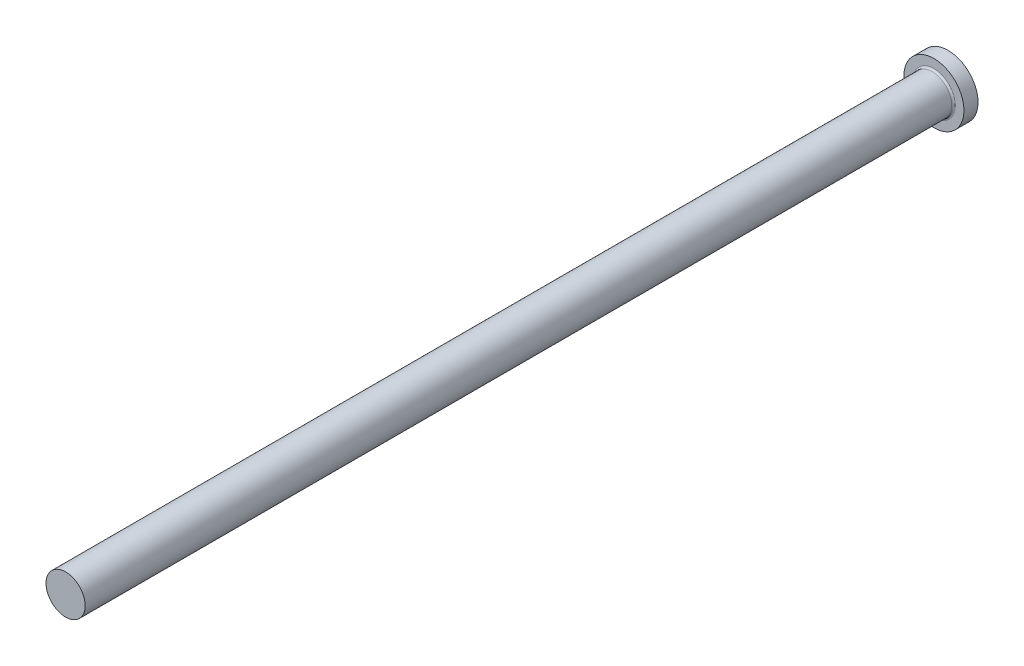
ISO-10303-21;
HEADER;
FILE_DESCRIPTION(('STEP AP214'),'2;1');
FILE_NAME('part.step','',(''),(''),'','','');
FILE_SCHEMA(('AUTOMOTIVE_DESIGN { 1 0 10303 214 1 1 1 1 }'));
ENDSEC;
DATA;
#1=APPLICATION_CONTEXT('core data for automotive mechanical design processes');
#2=APPLICATION_PROTOCOL_DEFINITION('international standard','automotive_design',2000,#1);
#3=PRODUCT_CONTEXT('',#1,'mechanical');
#4=PRODUCT('Part','Part','',(#3));
#5=PRODUCT_RELATED_PRODUCT_CATEGORY('part','',(#4));
#6=PRODUCT_DEFINITION_FORMATION('','',#4);
#7=PRODUCT_DEFINITION_CONTEXT('part definition',#1,'design');
#8=PRODUCT_DEFINITION('design','',#6,#7);
#9=PRODUCT_DEFINITION_SHAPE('','',#8);
#10=(LENGTH_UNIT() NAMED_UNIT(*) SI_UNIT(.MILLI.,.METRE.));
#11=(NAMED_UNIT(*) PLANE_ANGLE_UNIT() SI_UNIT($,.RADIAN.));
#12=(NAMED_UNIT(*) SI_UNIT($,.STERADIAN.) SOLID_ANGLE_UNIT());
#13=UNCERTAINTY_MEASURE_WITH_UNIT(LENGTH_MEASURE(1.E-05),#10,'distance_accuracy_value','');
#14=(GEOMETRIC_REPRESENTATION_CONTEXT(3) GLOBAL_UNCERTAINTY_ASSIGNED_CONTEXT((#13)) GLOBAL_UNIT_ASSIGNED_CONTEXT((#10,
#11,#12)) REPRESENTATION_CONTEXT('',''));
#15=CARTESIAN_POINT('',(0.,0.,0.));
#16=DIRECTION('',(0.,0.,1.));
#17=DIRECTION('',(1.,0.,0.));
#18=AXIS2_PLACEMENT_3D('',#15,#16,#17);
#19=CARTESIAN_POINT('',(8.5,0.,4.));
#20=DIRECTION('',(0.,0.,-1.));
#21=DIRECTION('',(-1.,0.,0.));
#22=AXIS2_PLACEMENT_3D('',#19,#20,#21);
#23=PLANE('',#22);
#24=CARTESIAN_POINT('',(0.,0.,4.));
#25=DIRECTION('',(0.,0.,-1.));
#26=DIRECTION('',(-1.,0.,0.));
#27=AXIS2_PLACEMENT_3D('',#24,#25,#26);
#28=CIRCLE('',#27,6.05000000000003);
#29=CARTESIAN_POINT('',(-6.05000000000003,0.,4.));
#30=VERTEX_POINT('',#29);
#31=EDGE_CURVE('E40',#30,#30,#28,.T.);
#32=ORIENTED_EDGE('',*,*,#31,.T.);
#33=EDGE_LOOP('',(#32));
#34=FACE_BOUND('',#33,.T.);
#35=CARTESIAN_POINT('',(0.,0.,4.));
#36=DIRECTION('',(0.,0.,-1.));
#37=DIRECTION('',(-1.,0.,0.));
#38=AXIS2_PLACEMENT_3D('',#35,#36,#37);
#39=CIRCLE('',#38,8.5);
#40=CARTESIAN_POINT('',(-8.5,0.,4.));
#41=VERTEX_POINT('',#40);
#42=EDGE_CURVE('E44',#41,#41,#39,.T.);
#43=ORIENTED_EDGE('',*,*,#42,.F.);
#44=EDGE_LOOP('',(#43));
#45=FACE_BOUND('',#44,.T.);
#46=ADVANCED_FACE('F33',(#34,#45),#23,.F.);
#47=CARTESIAN_POINT('',(0.,0.,-9.03322817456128));
#48=DIRECTION('',(0.,0.,-1.));
#49=DIRECTION('',(-1.,0.,0.));
#50=AXIS2_PLACEMENT_3D('',#47,#48,#49);
#51=CYLINDRICAL_SURFACE('',#50,8.5);
#52=CARTESIAN_POINT('',(0.,0.,0.));
#53=DIRECTION('',(0.,0.,-1.));
#54=DIRECTION('',(-1.,0.,0.));
#55=AXIS2_PLACEMENT_3D('',#52,#53,#54);
#56=CIRCLE('',#55,8.5);
#57=CARTESIAN_POINT('',(-8.5,0.,0.));
#58=VERTEX_POINT('',#57);
#59=EDGE_CURVE('E48',#58,#58,#56,.T.);
#60=ORIENTED_EDGE('',*,*,#59,.F.);
#61=EDGE_LOOP('',(#60));
#62=FACE_BOUND('',#61,.T.);
#63=ORIENTED_EDGE('',*,*,#42,.T.);
#64=EDGE_LOOP('',(#63));
#65=FACE_BOUND('',#64,.T.);
#66=ADVANCED_FACE('F68',(#62,#65),#51,.T.);
#67=CARTESIAN_POINT('',(0.,0.,0.));
#68=DIRECTION('',(0.,0.,1.));
#69=DIRECTION('',(1.,0.,0.));
#70=AXIS2_PLACEMENT_3D('',#67,#68,#69);
#71=PLANE('',#70);
#72=ORIENTED_EDGE('',*,*,#59,.T.);
#73=EDGE_LOOP('',(#72));
#74=FACE_BOUND('',#73,.T.);
#75=ADVANCED_FACE('F61',(#74),#71,.F.);
#76=CARTESIAN_POINT('',(0.,0.,250.));
#77=DIRECTION('',(0.,0.,-1.));
#78=DIRECTION('',(-1.,0.,0.));
#79=AXIS2_PLACEMENT_3D('',#76,#77,#78);
#80=PLANE('',#79);
#81=CARTESIAN_POINT('',(0.,0.,250.));
#82=DIRECTION('',(0.,0.,-1.));
#83=DIRECTION('',(-1.,0.,0.));
#84=AXIS2_PLACEMENT_3D('',#81,#82,#83);
#85=CIRCLE('',#84,5.55000000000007);
#86=CARTESIAN_POINT('',(-5.55000000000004,0.,250.));
#87=VERTEX_POINT('',#86);
#88=EDGE_CURVE('E53',#87,#87,#85,.T.);
#89=ORIENTED_EDGE('',*,*,#88,.F.);
#90=EDGE_LOOP('',(#89));
#91=FACE_BOUND('',#90,.T.);
#92=ADVANCED_FACE('F59',(#91),#80,.F.);
#93=CARTESIAN_POINT('',(0.,0.,-9.03322817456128));
#94=DIRECTION('',(0.,0.,-1.));
#95=DIRECTION('',(-1.,0.,0.));
#96=AXIS2_PLACEMENT_3D('',#93,#94,#95);
#97=CYLINDRICAL_SURFACE('',#96,5.55000000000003);
#98=CARTESIAN_POINT('',(0.,0.,4.5));
#99=DIRECTION('',(0.,0.,-1.));
#100=DIRECTION('',(-1.,0.,0.));
#101=AXIS2_PLACEMENT_3D('',#98,#99,#100);
#102=CIRCLE('',#101,5.55000000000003);
#103=CARTESIAN_POINT('',(-5.55000000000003,0.,4.5));
#104=VERTEX_POINT('',#103);
#105=EDGE_CURVE('E10',#104,#104,#102,.F.);
#106=ORIENTED_EDGE('',*,*,#105,.T.);
#107=EDGE_LOOP('',(#106));
#108=FACE_BOUND('',#107,.T.);
#109=ORIENTED_EDGE('',*,*,#88,.T.);
#110=EDGE_LOOP('',(#109));
#111=FACE_BOUND('',#110,.T.);
#112=ADVANCED_FACE('F57',(#108,#111),#97,.T.);
#113=CARTESIAN_POINT('',(0.,0.,4.5));
#114=DIRECTION('',(0.,0.,-1.));
#115=DIRECTION('',(-1.,0.,0.));
#116=AXIS2_PLACEMENT_3D('',#113,#114,#115);
#117=TOROIDAL_SURFACE('',#116,6.05000000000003,0.5);
#118=ORIENTED_EDGE('',*,*,#105,.F.);
#119=EDGE_LOOP('',(#118));
#120=FACE_BOUND('',#119,.T.);
#121=ORIENTED_EDGE('',*,*,#31,.F.);
#122=EDGE_LOOP('',(#121));
#123=FACE_BOUND('',#122,.T.);
#124=ADVANCED_FACE('F35',(#120,#123),#117,.F.);
#125=CLOSED_SHELL('',(#46,#66,#75,#92,#112,#124));
#126=MANIFOLD_SOLID_BREP('B2',#125);
#127=ADVANCED_BREP_SHAPE_REPRESENTATION('',(#18,#126),#14);
#128=SHAPE_DEFINITION_REPRESENTATION(#9,#127);
ENDSEC;
END-ISO-10303-21;
